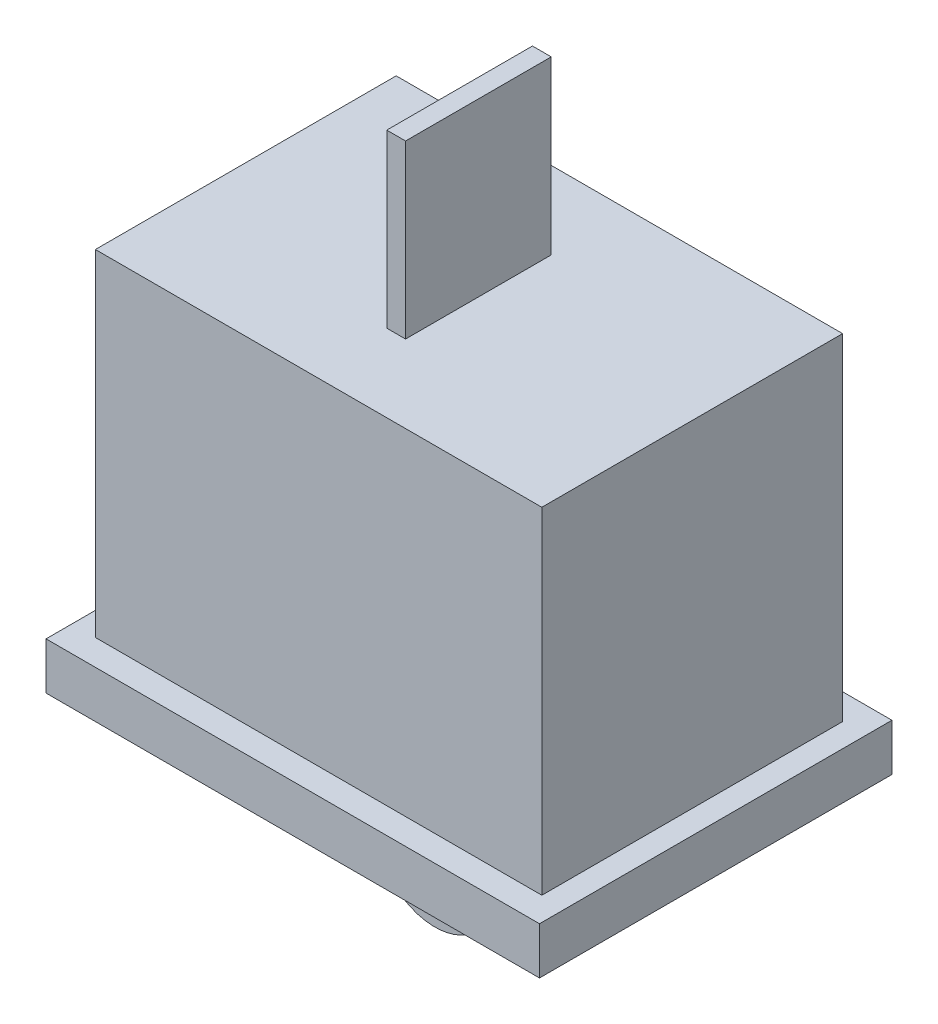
from build123d import *

# Parameters (mm, degrees)
SKETCH_1_W      = 21
SKETCH_1_H      = 15
EXTRUDE_1_DEPTH = 2
SKETCH_2_W      = 19
SKETCH_2_H      = 12.8
EXTRUDE_2_DEPTH = 14.3
SKETCH_3_W      = 0.8
SKETCH_3_H      = 6.2
EXTRUDE_3_DEPTH = 7.3
EXTRUDE_4_DEPTH = 5


with BuildPart() as part:
    # Sketch 1 → Extrude 1 (new body)
    with BuildSketch(Plane(origin=(0, 0, 0), x_dir=(1, 0, 0), z_dir=(0, 1, 0))):
        Rectangle(SKETCH_1_W, SKETCH_1_H)
    extrude(amount=EXTRUDE_1_DEPTH)

    # Sketch 2 → Extrude 2 (add)
    with BuildSketch(Plane(origin=(0, 2, 0), x_dir=(1, 0, 0), z_dir=(0, 1, 0))):
        Rectangle(SKETCH_2_W, SKETCH_2_H)
    extrude(amount=EXTRUDE_2_DEPTH)

    # Sketch 3 → Extrude 3 (add)
    with BuildSketch(Plane(origin=(0, 16.3, 0), x_dir=(1, 0, 0), z_dir=(0, 1, 0))):
        Rectangle(SKETCH_3_W, SKETCH_3_H)
    extrude(amount=EXTRUDE_3_DEPTH)

    # Sketch 4 → Extrude 4 (add, symmetric)
    with BuildSketch(Plane.XY):
        with BuildLine():
            Line((-4.665884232, 0), (6.053685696, 0))
            ThreePointArc((6.053685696, 0), (4.792759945, -2.520618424), (1.982522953, -2.30609794))
            ThreePointArc((1.982522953, -2.30609794), (-1.147382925, -0.592894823), (-4.665884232, 0))
        make_face()
    extrude(amount=EXTRUDE_4_DEPTH, both=True)


solid = part.part
